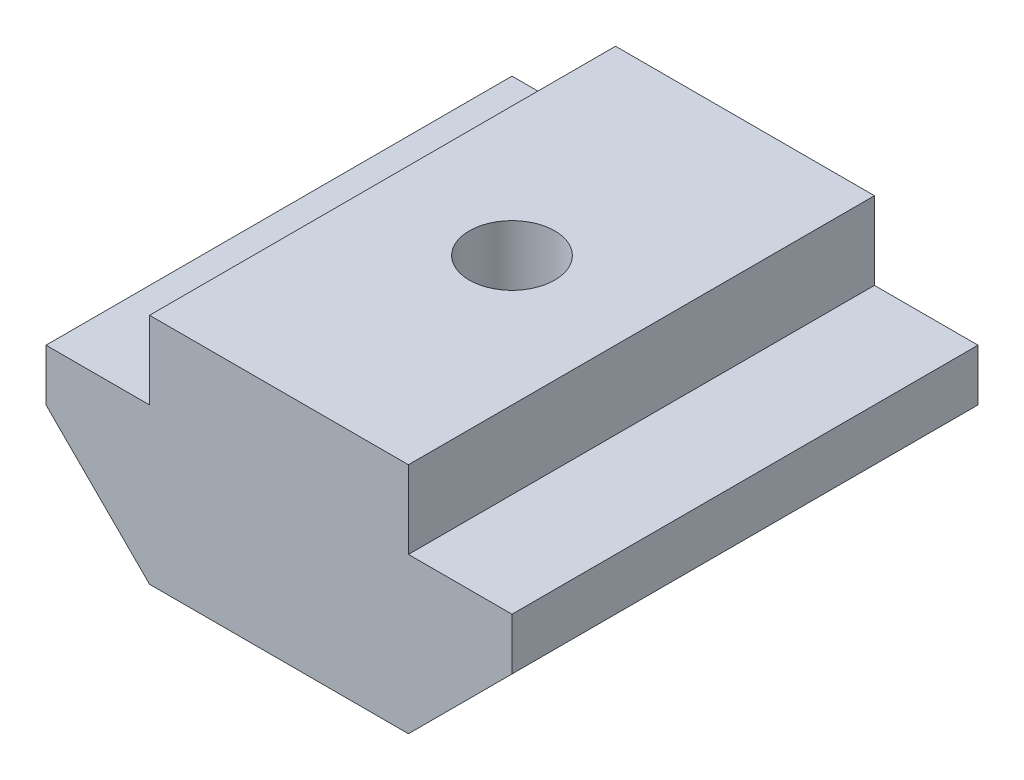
from build123d import *

# Parameters (mm, degrees)
EXTRUDE_1_DEPTH    = 18
HOLE_WIZARD_M4_1_D = 3.3


with BuildPart() as part:
    # Sketch 1 → Extrude 1 (new body)
    with BuildSketch(Plane.XY):
        Polygon((0, 0), (4, 0), (4, 3), (14, 3), (14, 0), (18, 0), (18, -2), (14, -6), (4, -6), (0, -2), align=None)
    extrude(amount=EXTRUDE_1_DEPTH)

    # Hole Wizard M4 _1 (through all)
    with Locations(Plane(origin=(9, 3, 9), x_dir=(0, 0, 1), z_dir=(0, 1, 0))):
        with Locations((0, 0)):
            Hole(HOLE_WIZARD_M4_1_D / 2)


solid = part.part
